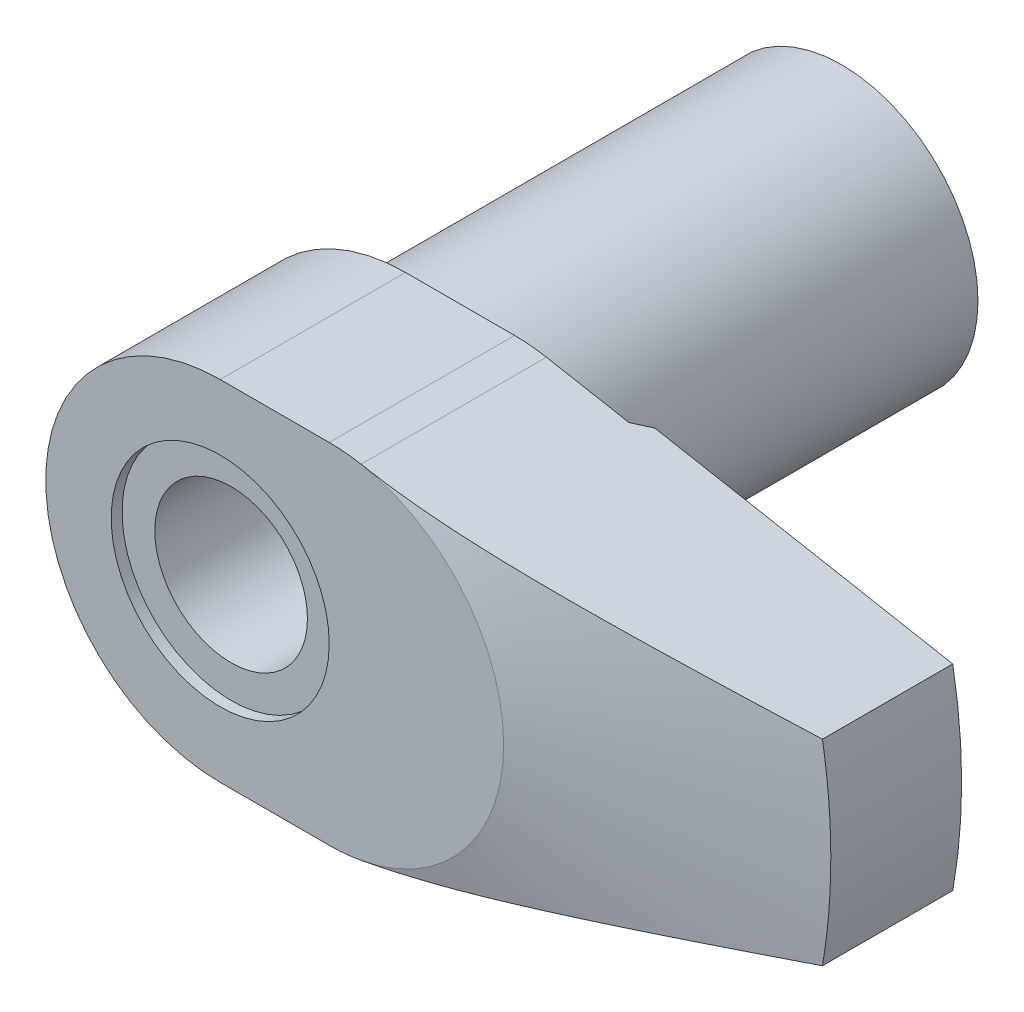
ISO-10303-21;
HEADER;
FILE_DESCRIPTION(('STEP AP214'),'2;1');
FILE_NAME('part.step','',(''),(''),'','','');
FILE_SCHEMA(('AUTOMOTIVE_DESIGN { 1 0 10303 214 1 1 1 1 }'));
ENDSEC;
DATA;
#1=APPLICATION_CONTEXT('core data for automotive mechanical design processes');
#2=APPLICATION_PROTOCOL_DEFINITION('international standard','automotive_design',2000,#1);
#3=PRODUCT_CONTEXT('',#1,'mechanical');
#4=PRODUCT('Part','Part','',(#3));
#5=PRODUCT_RELATED_PRODUCT_CATEGORY('part','',(#4));
#6=PRODUCT_DEFINITION_FORMATION('','',#4);
#7=PRODUCT_DEFINITION_CONTEXT('part definition',#1,'design');
#8=PRODUCT_DEFINITION('design','',#6,#7);
#9=PRODUCT_DEFINITION_SHAPE('','',#8);
#10=(LENGTH_UNIT() NAMED_UNIT(*) SI_UNIT(.MILLI.,.METRE.));
#11=(NAMED_UNIT(*) PLANE_ANGLE_UNIT() SI_UNIT($,.RADIAN.));
#12=(NAMED_UNIT(*) SI_UNIT($,.STERADIAN.) SOLID_ANGLE_UNIT());
#13=UNCERTAINTY_MEASURE_WITH_UNIT(LENGTH_MEASURE(1.E-05),#10,'distance_accuracy_value','');
#14=(GEOMETRIC_REPRESENTATION_CONTEXT(3) GLOBAL_UNCERTAINTY_ASSIGNED_CONTEXT((#13)) GLOBAL_UNIT_ASSIGNED_CONTEXT((#10,
#11,#12)) REPRESENTATION_CONTEXT('',''));
#15=CARTESIAN_POINT('',(0.,0.,0.));
#16=DIRECTION('',(0.,0.,1.));
#17=DIRECTION('',(1.,0.,0.));
#18=AXIS2_PLACEMENT_3D('',#15,#16,#17);
#19=CARTESIAN_POINT('',(10.,0.,39.));
#20=DIRECTION('',(0.,0.,1.));
#21=DIRECTION('',(1.,0.,0.));
#22=AXIS2_PLACEMENT_3D('',#19,#20,#21);
#23=CYLINDRICAL_SURFACE('',#22,16.);
#24=DIRECTION('',(0.,0.,1.));
#25=VECTOR('',#24,1.);
#26=CARTESIAN_POINT('',(12.9200808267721,15.7312786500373,39.));
#27=LINE('',#26,#25);
#28=CARTESIAN_POINT('',(12.9200808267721,15.7312786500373,40.));
#29=VERTEX_POINT('',#28);
#30=CARTESIAN_POINT('',(12.9200808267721,15.7312786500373,57.));
#31=VERTEX_POINT('',#30);
#32=EDGE_CURVE('E137',#29,#31,#27,.T.);
#33=ORIENTED_EDGE('',*,*,#32,.F.);
#34=CARTESIAN_POINT('',(10.,0.,40.));
#35=DIRECTION('',(0.,0.,-1.));
#36=DIRECTION('',(-1.,0.,0.));
#37=AXIS2_PLACEMENT_3D('',#34,#35,#36);
#38=CIRCLE('',#37,16.);
#39=CARTESIAN_POINT('',(10.,16.,40.));
#40=VERTEX_POINT('',#39);
#41=EDGE_CURVE('E214',#40,#29,#38,.T.);
#42=ORIENTED_EDGE('',*,*,#41,.F.);
#43=DIRECTION('',(0.,0.,1.));
#44=VECTOR('',#43,1.);
#45=CARTESIAN_POINT('',(10.,16.,39.));
#46=LINE('',#45,#44);
#47=CARTESIAN_POINT('',(10.,16.,57.));
#48=VERTEX_POINT('',#47);
#49=EDGE_CURVE('E149',#40,#48,#46,.T.);
#50=ORIENTED_EDGE('',*,*,#49,.T.);
#51=CARTESIAN_POINT('',(10.,0.,57.));
#52=DIRECTION('',(0.,0.,1.));
#53=DIRECTION('',(1.,0.,0.));
#54=AXIS2_PLACEMENT_3D('',#51,#52,#53);
#55=CIRCLE('',#54,16.);
#56=EDGE_CURVE('E242',#31,#48,#55,.T.);
#57=ORIENTED_EDGE('',*,*,#56,.F.);
#58=EDGE_LOOP('',(#33,#42,#50,#57));
#59=FACE_BOUND('',#58,.T.);
#60=ADVANCED_FACE('F14',(#59),#23,.T.);
#61=CARTESIAN_POINT('',(49.1833305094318,9.,39.));
#62=DIRECTION('',(0.182505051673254,0.983204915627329,0.));
#63=DIRECTION('',(-0.983204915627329,0.182505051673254,0.));
#64=AXIS2_PLACEMENT_3D('',#61,#62,#63);
#65=PLANE('',#64);
#66=CARTESIAN_POINT('',(49.1835305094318,8.99996287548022,50.9490411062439));
#67=CARTESIAN_POINT('',(48.4363157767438,9.13866281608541,51.1233294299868));
#68=CARTESIAN_POINT('',(47.6889224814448,9.27739590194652,51.2968298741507));
#69=CARTESIAN_POINT('',(46.1937064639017,9.5549417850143,51.6419204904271));
#70=CARTESIAN_POINT('',(45.4458837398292,9.69375458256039,51.8135106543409));
#71=CARTESIAN_POINT('',(43.9498561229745,9.97145111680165,52.1544189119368));
#72=CARTESIAN_POINT('',(43.2016513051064,10.1103348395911,52.3237373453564));
#73=CARTESIAN_POINT('',(41.7046595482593,10.3882103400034,52.6596906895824));
#74=CARTESIAN_POINT('',(40.9558726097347,10.527202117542,52.8263256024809));
#75=CARTESIAN_POINT('',(39.4594248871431,10.8049766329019,53.1559693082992));
#76=CARTESIAN_POINT('',(38.7117657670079,10.94375906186,53.3189859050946));
#77=CARTESIAN_POINT('',(37.2156374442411,11.2214742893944,53.641125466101));
#78=CARTESIAN_POINT('',(36.4671682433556,11.3604070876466,53.8002484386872));
#79=CARTESIAN_POINT('',(34.9690951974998,11.6384832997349,54.1137697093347));
#80=CARTESIAN_POINT('',(34.2194911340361,11.7776267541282,54.2681669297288));
#81=CARTESIAN_POINT('',(32.7191323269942,12.0561272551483,54.571090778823));
#82=CARTESIAN_POINT('',(31.9683775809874,12.1954843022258,54.7196173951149));
#83=CARTESIAN_POINT('',(30.4629252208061,12.4749302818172,55.0098772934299));
#84=CARTESIAN_POINT('',(29.7082229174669,12.6150200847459,55.1515855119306));
#85=CARTESIAN_POINT('',(28.1972026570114,12.8954995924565,55.4258274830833));
#86=CARTESIAN_POINT('',(27.4408847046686,13.0358892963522,55.558361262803));
#87=CARTESIAN_POINT('',(25.9267833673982,13.3169407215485,55.8118665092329));
#88=CARTESIAN_POINT('',(25.1690009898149,13.4576022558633,55.9328441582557));
#89=CARTESIAN_POINT('',(23.6513180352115,13.7393185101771,56.1604558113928));
#90=CARTESIAN_POINT('',(22.8914174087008,13.8803732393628,56.267089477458));
#91=CARTESIAN_POINT('',(21.3673908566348,14.163267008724,56.4628797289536));
#92=CARTESIAN_POINT('',(20.6032590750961,14.3051071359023,56.5519896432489));
#93=CARTESIAN_POINT('',(19.0728856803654,14.5891790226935,56.7086223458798));
#94=CARTESIAN_POINT('',(18.3066442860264,14.7314107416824,56.7761472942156));
#95=CARTESIAN_POINT('',(17.1552699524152,14.9451318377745,56.8586386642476));
#96=CARTESIAN_POINT('',(16.7707772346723,15.0165023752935,56.8830172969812));
#97=CARTESIAN_POINT('',(16.0014376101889,15.1593091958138,56.92510762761));
#98=CARTESIAN_POINT('',(15.6165907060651,15.2307454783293,56.9428193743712));
#99=CARTESIAN_POINT('',(14.8465043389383,15.3736909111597,56.9712828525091));
#100=CARTESIAN_POINT('',(14.461264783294,15.4452000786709,56.9820320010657));
#101=CARTESIAN_POINT('',(13.690644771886,15.5882445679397,56.996402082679));
#102=CARTESIAN_POINT('',(13.3052643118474,15.6597798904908,57.0000227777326));
#103=CARTESIAN_POINT('',(12.919880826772,15.731315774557,56.9999999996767));
#104=B_SPLINE_CURVE_WITH_KNOTS('',3,(#66,#67,#68,#69,#70,#71,#72,#73,#74,#75,#76,#77,#78,#79,
#80,#81,#82,#83,#84,#85,#86,#87,#88,#89,#90,#91,#92,#93,#94,#95,#96,#97,#98,#99,#100,#101,#102,
#103),.UNSPECIFIED.,.F.,.F.,(4,2,2,2,2,2,2,2,2,2,2,2,2,2,2,2,2,2,4),(0.,2.33912374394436,
4.67825752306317,7.01703749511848,9.35581564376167,11.6889301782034,14.0220396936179,
16.3556773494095,18.689319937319,21.0309713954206,23.372615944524,25.7130006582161,
28.0534405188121,30.4000316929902,32.7463879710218,33.9217995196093,35.0972024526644,
36.2730411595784,37.4489191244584),.UNSPECIFIED.);
#105=CARTESIAN_POINT('',(49.1833305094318,9.,50.9490877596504));
#106=VERTEX_POINT('',#105);
#107=EDGE_CURVE('E98',#106,#31,#104,.T.);
#108=ORIENTED_EDGE('',*,*,#107,.F.);
#109=DIRECTION('',(0.,0.,1.));
#110=VECTOR('',#109,1.);
#111=CARTESIAN_POINT('',(49.1833305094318,9.,39.));
#112=LINE('',#111,#110);
#113=CARTESIAN_POINT('',(49.1833305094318,9.,39.));
#114=VERTEX_POINT('',#113);
#115=EDGE_CURVE('E140',#114,#106,#112,.T.);
#116=ORIENTED_EDGE('',*,*,#115,.F.);
#117=DIRECTION('',(-0.983204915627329,0.182505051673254,0.));
#118=VECTOR('',#117,1.);
#119=CARTESIAN_POINT('',(49.1833305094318,9.,39.));
#120=LINE('',#119,#118);
#121=CARTESIAN_POINT('',(21.8632225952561,14.0712294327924,39.));
#122=VERTEX_POINT('',#121);
#123=EDGE_CURVE('E151',#114,#122,#120,.T.);
#124=ORIENTED_EDGE('',*,*,#123,.T.);
#125=CARTESIAN_POINT('',(20.4875288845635,14.3265892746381,40.0002));
#126=CARTESIAN_POINT('',(20.60293771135,14.305166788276,39.917897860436));
#127=CARTESIAN_POINT('',(20.7181524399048,14.2837803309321,39.8353143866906));
#128=CARTESIAN_POINT('',(20.948203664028,14.2410776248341,39.6696090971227));
#129=CARTESIAN_POINT('',(21.0630401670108,14.2197613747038,39.586487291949));
#130=CARTESIAN_POINT('',(21.2923493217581,14.177196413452,39.4197265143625));
#131=CARTESIAN_POINT('',(21.4068219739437,14.1559477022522,39.3360875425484));
#132=CARTESIAN_POINT('',(21.6354174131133,14.1135152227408,39.1683116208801));
#133=CARTESIAN_POINT('',(21.7495401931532,14.092331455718,39.0841746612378));
#134=CARTESIAN_POINT('',(21.8634927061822,14.0711792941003,38.9998));
#135=B_SPLINE_CURVE_WITH_KNOTS('',3,(#125,#126,#127,#128,#129,#130,#131,#132,#133,#134),
.UNSPECIFIED.,.F.,.F.,(4,2,2,2,4),(0.,0.430075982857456,0.860143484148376,1.29021048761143,
1.72028597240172),.UNSPECIFIED.);
#136=CARTESIAN_POINT('',(20.4878093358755,14.3265372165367,40.));
#137=VERTEX_POINT('',#136);
#138=EDGE_CURVE('E190',#137,#122,#135,.T.);
#139=ORIENTED_EDGE('',*,*,#138,.F.);
#140=DIRECTION('',(0.983204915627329,-0.182505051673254,0.));
#141=VECTOR('',#140,1.);
#142=CARTESIAN_POINT('',(12.9200808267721,15.7312786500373,40.));
#143=LINE('',#142,#141);
#144=EDGE_CURVE('E220',#29,#137,#143,.T.);
#145=ORIENTED_EDGE('',*,*,#144,.F.);
#146=ORIENTED_EDGE('',*,*,#32,.T.);
#147=EDGE_LOOP('',(#108,#116,#124,#139,#145,#146));
#148=FACE_BOUND('',#147,.T.);
#149=ADVANCED_FACE('F201',(#148),#65,.T.);
#150=CARTESIAN_POINT('',(49.1833305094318,-9.,39.));
#151=DIRECTION('',(0.182505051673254,-0.983204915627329,0.));
#152=DIRECTION('',(0.983204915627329,0.182505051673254,0.));
#153=AXIS2_PLACEMENT_3D('',#150,#151,#152);
#154=PLANE('',#153);
#155=CARTESIAN_POINT('',(12.9198808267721,-15.731315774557,56.9999999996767));
#156=CARTESIAN_POINT('',(13.2556839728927,-15.6689831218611,57.000013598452));
#157=CARTESIAN_POINT('',(13.5914855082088,-15.6066507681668,56.9972685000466));
#158=CARTESIAN_POINT('',(14.2629969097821,-15.4820030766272,56.9863525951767));
#159=CARTESIAN_POINT('',(14.598706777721,-15.4196877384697,56.9781818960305));
#160=CARTESIAN_POINT('',(15.2698792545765,-15.2951029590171,56.9565090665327));
#161=CARTESIAN_POINT('',(15.6053419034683,-15.2328335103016,56.9430082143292));
#162=CARTESIAN_POINT('',(16.2760267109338,-15.1083392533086,56.9108512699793));
#163=CARTESIAN_POINT('',(16.6112488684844,-15.0461144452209,56.8921951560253));
#164=CARTESIAN_POINT('',(17.6154285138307,-14.8597160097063,56.8288816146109));
#165=CARTESIAN_POINT('',(18.2839458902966,-14.7356240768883,56.7768438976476));
#166=CARTESIAN_POINT('',(19.6194519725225,-14.4877239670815,56.6552810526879));
#167=CARTESIAN_POINT('',(20.2864405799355,-14.3639158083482,56.5857548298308));
#168=CARTESIAN_POINT('',(21.6170626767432,-14.1169222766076,56.4318958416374));
#169=CARTESIAN_POINT('',(22.2807003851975,-13.9937361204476,56.347600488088));
#170=CARTESIAN_POINT('',(23.6062973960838,-13.7476753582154,56.1664804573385));
#171=CARTESIAN_POINT('',(24.268256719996,-13.624800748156,56.0696559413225));
#172=CARTESIAN_POINT('',(25.5909090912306,-13.3792865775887,55.8655833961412));
#173=CARTESIAN_POINT('',(26.2516014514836,-13.2566471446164,55.7583307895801));
#174=CARTESIAN_POINT('',(27.5715919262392,-13.0116270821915,55.5352732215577));
#175=CARTESIAN_POINT('',(28.2308900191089,-12.8892464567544,55.419468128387));
#176=CARTESIAN_POINT('',(29.7391756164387,-12.6092745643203,55.1462586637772));
#177=CARTESIAN_POINT('',(30.5877543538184,-12.4517591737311,54.9865259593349));
#178=CARTESIAN_POINT('',(32.2832079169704,-12.1370446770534,54.657987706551));
#179=CARTESIAN_POINT('',(33.1300827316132,-11.9798455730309,54.4891820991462));
#180=CARTESIAN_POINT('',(34.8223003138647,-11.6657317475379,54.1444787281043));
#181=CARTESIAN_POINT('',(35.6676432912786,-11.5088169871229,53.9685820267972));
#182=CARTESIAN_POINT('',(37.3571768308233,-11.1952013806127,53.6111544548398));
#183=CARTESIAN_POINT('',(38.2013673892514,-11.0385005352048,53.429623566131));
#184=CARTESIAN_POINT('',(39.8914780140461,-10.7247778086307,53.061469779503));
#185=CARTESIAN_POINT('',(40.7373950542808,-10.5677564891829,52.8748325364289));
#186=CARTESIAN_POINT('',(42.4284393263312,-10.2538604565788,52.4978887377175));
#187=CARTESIAN_POINT('',(43.2735665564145,-10.096985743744,52.3075821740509));
#188=CARTESIAN_POINT('',(44.963151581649,-9.78336058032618,51.9239804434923));
#189=CARTESIAN_POINT('',(45.807609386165,-9.62661012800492,51.7306853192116));
#190=CARTESIAN_POINT('',(47.4959636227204,-9.31321342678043,51.3416056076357));
#191=CARTESIAN_POINT('',(48.3398600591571,-9.15656717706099,51.1458210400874));
#192=CARTESIAN_POINT('',(49.1835305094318,-8.99996287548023,50.9490411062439));
#193=B_SPLINE_CURVE_WITH_KNOTS('',3,(#155,#156,#157,#158,#159,#160,#161,#162,#163,#164,#165,
#166,#167,#168,#169,#170,#171,#172,#173,#174,#175,#176,#177,#178,#179,#180,#181,#182,#183,#184,
#185,#186,#187,#188,#189,#190,#191,#192),.UNSPECIFIED.,.F.,.F.,(4,2,2,2,2,2,2,2,2,2,2,2,2,2,2,2,
2,2,4),(0.,1.02460419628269,2.04918812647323,3.07352651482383,4.09786923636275,6.14336042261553,
8.18897969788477,10.2294902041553,12.2699744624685,14.3113584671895,16.3527739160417,
18.9859001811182,21.6190435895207,24.2517939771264,26.8845528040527,29.5256759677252,
32.1668049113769,34.8078962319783,37.4489666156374),.UNSPECIFIED.);
#194=CARTESIAN_POINT('',(12.9200808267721,-15.7312786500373,57.));
#195=VERTEX_POINT('',#194);
#196=CARTESIAN_POINT('',(49.1833305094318,-9.,50.9490877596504));
#197=VERTEX_POINT('',#196);
#198=EDGE_CURVE('E34',#195,#197,#193,.T.);
#199=ORIENTED_EDGE('',*,*,#198,.F.);
#200=DIRECTION('',(0.,0.,1.));
#201=VECTOR('',#200,1.);
#202=CARTESIAN_POINT('',(12.9200808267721,-15.7312786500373,39.));
#203=LINE('',#202,#201);
#204=CARTESIAN_POINT('',(12.9200808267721,-15.7312786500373,40.));
#205=VERTEX_POINT('',#204);
#206=EDGE_CURVE('E110',#205,#195,#203,.T.);
#207=ORIENTED_EDGE('',*,*,#206,.F.);
#208=DIRECTION('',(-0.983204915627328,-0.182505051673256,0.));
#209=VECTOR('',#208,1.);
#210=CARTESIAN_POINT('',(20.4878093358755,-14.3265372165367,40.));
#211=LINE('',#210,#209);
#212=CARTESIAN_POINT('',(20.4878093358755,-14.3265372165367,40.));
#213=VERTEX_POINT('',#212);
#214=EDGE_CURVE('E222',#213,#205,#211,.T.);
#215=ORIENTED_EDGE('',*,*,#214,.F.);
#216=CARTESIAN_POINT('',(21.8634927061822,-14.0711792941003,38.9998));
#217=CARTESIAN_POINT('',(21.7495401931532,-14.092331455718,39.0841746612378));
#218=CARTESIAN_POINT('',(21.6354174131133,-14.1135152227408,39.1683116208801));
#219=CARTESIAN_POINT('',(21.4068219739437,-14.1559477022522,39.3360875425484));
#220=CARTESIAN_POINT('',(21.2923493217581,-14.177196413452,39.4197265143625));
#221=CARTESIAN_POINT('',(21.0630401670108,-14.2197613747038,39.586487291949));
#222=CARTESIAN_POINT('',(20.948203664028,-14.2410776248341,39.6696090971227));
#223=CARTESIAN_POINT('',(20.7181524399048,-14.2837803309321,39.8353143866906));
#224=CARTESIAN_POINT('',(20.60293771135,-14.305166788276,39.917897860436));
#225=CARTESIAN_POINT('',(20.4875288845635,-14.3265892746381,40.0002));
#226=B_SPLINE_CURVE_WITH_KNOTS('',3,(#216,#217,#218,#219,#220,#221,#222,#223,#224,#225),
.UNSPECIFIED.,.F.,.F.,(4,2,2,2,4),(0.,0.430075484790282,0.860142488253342,1.29020998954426,
1.72028597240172),.UNSPECIFIED.);
#227=CARTESIAN_POINT('',(21.8632225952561,-14.0712294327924,39.));
#228=VERTEX_POINT('',#227);
#229=EDGE_CURVE('E28',#228,#213,#226,.T.);
#230=ORIENTED_EDGE('',*,*,#229,.F.);
#231=DIRECTION('',(0.983204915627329,0.182505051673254,0.));
#232=VECTOR('',#231,1.);
#233=CARTESIAN_POINT('',(49.1833305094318,-9.,39.));
#234=LINE('',#233,#232);
#235=CARTESIAN_POINT('',(49.1833305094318,-9.,39.));
#236=VERTEX_POINT('',#235);
#237=EDGE_CURVE('E129',#228,#236,#234,.T.);
#238=ORIENTED_EDGE('',*,*,#237,.T.);
#239=DIRECTION('',(0.,0.,1.));
#240=VECTOR('',#239,1.);
#241=CARTESIAN_POINT('',(49.1833305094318,-9.,39.));
#242=LINE('',#241,#240);
#243=EDGE_CURVE('E112',#236,#197,#242,.T.);
#244=ORIENTED_EDGE('',*,*,#243,.T.);
#245=EDGE_LOOP('',(#199,#207,#215,#230,#238,#244));
#246=FACE_BOUND('',#245,.T.);
#247=ADVANCED_FACE('F108',(#246),#154,.T.);
#248=CARTESIAN_POINT('',(10.,0.,39.));
#249=DIRECTION('',(0.,0.,1.));
#250=DIRECTION('',(1.,0.,0.));
#251=AXIS2_PLACEMENT_3D('',#248,#249,#250);
#252=CYLINDRICAL_SURFACE('',#251,16.);
#253=DIRECTION('',(0.,0.,1.));
#254=VECTOR('',#253,1.);
#255=CARTESIAN_POINT('',(10.,-16.,39.));
#256=LINE('',#255,#254);
#257=CARTESIAN_POINT('',(10.,-16.,40.));
#258=VERTEX_POINT('',#257);
#259=CARTESIAN_POINT('',(10.,-16.,57.));
#260=VERTEX_POINT('',#259);
#261=EDGE_CURVE('E122',#258,#260,#256,.T.);
#262=ORIENTED_EDGE('',*,*,#261,.F.);
#263=CARTESIAN_POINT('',(10.,0.,40.));
#264=DIRECTION('',(0.,0.,-1.));
#265=DIRECTION('',(-1.,0.,0.));
#266=AXIS2_PLACEMENT_3D('',#263,#264,#265);
#267=CIRCLE('',#266,16.);
#268=EDGE_CURVE('E121',#205,#258,#267,.T.);
#269=ORIENTED_EDGE('',*,*,#268,.F.);
#270=ORIENTED_EDGE('',*,*,#206,.T.);
#271=CARTESIAN_POINT('',(10.,0.,57.));
#272=DIRECTION('',(0.,0.,1.));
#273=DIRECTION('',(1.,0.,0.));
#274=AXIS2_PLACEMENT_3D('',#271,#272,#273);
#275=CIRCLE('',#274,16.);
#276=EDGE_CURVE('E119',#260,#195,#275,.T.);
#277=ORIENTED_EDGE('',*,*,#276,.F.);
#278=EDGE_LOOP('',(#262,#269,#270,#277));
#279=FACE_BOUND('',#278,.T.);
#280=ADVANCED_FACE('F118',(#279),#252,.T.);
#281=CARTESIAN_POINT('',(10.,-16.,39.));
#282=DIRECTION('',(0.,-1.,0.));
#283=DIRECTION('',(1.,0.,0.));
#284=AXIS2_PLACEMENT_3D('',#281,#282,#283);
#285=PLANE('',#284);
#286=DIRECTION('',(0.,0.,1.));
#287=VECTOR('',#286,1.);
#288=CARTESIAN_POINT('',(1.6759120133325E-13,-16.,39.));
#289=LINE('',#288,#287);
#290=CARTESIAN_POINT('',(0.,-16.,40.));
#291=VERTEX_POINT('',#290);
#292=CARTESIAN_POINT('',(1.6759120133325E-13,-16.,57.));
#293=VERTEX_POINT('',#292);
#294=EDGE_CURVE('E145',#291,#293,#289,.T.);
#295=ORIENTED_EDGE('',*,*,#294,.F.);
#296=DIRECTION('',(-1.,0.,0.));
#297=VECTOR('',#296,1.);
#298=CARTESIAN_POINT('',(10.,-16.,40.));
#299=LINE('',#298,#297);
#300=EDGE_CURVE('E225',#258,#291,#299,.T.);
#301=ORIENTED_EDGE('',*,*,#300,.F.);
#302=ORIENTED_EDGE('',*,*,#261,.T.);
#303=DIRECTION('',(1.,0.,0.));
#304=VECTOR('',#303,1.);
#305=CARTESIAN_POINT('',(10.,-16.,57.));
#306=LINE('',#305,#304);
#307=EDGE_CURVE('E128',#293,#260,#306,.T.);
#308=ORIENTED_EDGE('',*,*,#307,.F.);
#309=EDGE_LOOP('',(#295,#301,#302,#308));
#310=FACE_BOUND('',#309,.T.);
#311=ADVANCED_FACE('F257',(#310),#285,.T.);
#312=CARTESIAN_POINT('',(10.,16.,39.));
#313=DIRECTION('',(0.,1.,0.));
#314=DIRECTION('',(-1.,0.,0.));
#315=AXIS2_PLACEMENT_3D('',#312,#313,#314);
#316=PLANE('',#315);
#317=ORIENTED_EDGE('',*,*,#49,.F.);
#318=DIRECTION('',(1.,0.,0.));
#319=VECTOR('',#318,1.);
#320=CARTESIAN_POINT('',(0.,16.,40.));
#321=LINE('',#320,#319);
#322=CARTESIAN_POINT('',(0.,16.,40.));
#323=VERTEX_POINT('',#322);
#324=EDGE_CURVE('E227',#323,#40,#321,.T.);
#325=ORIENTED_EDGE('',*,*,#324,.F.);
#326=DIRECTION('',(0.,0.,1.));
#327=VECTOR('',#326,1.);
#328=CARTESIAN_POINT('',(0.,16.,39.));
#329=LINE('',#328,#327);
#330=CARTESIAN_POINT('',(0.,16.,57.));
#331=VERTEX_POINT('',#330);
#332=EDGE_CURVE('E147',#323,#331,#329,.T.);
#333=ORIENTED_EDGE('',*,*,#332,.T.);
#334=DIRECTION('',(-1.,0.,0.));
#335=VECTOR('',#334,1.);
#336=CARTESIAN_POINT('',(10.,16.,57.));
#337=LINE('',#336,#335);
#338=EDGE_CURVE('E133',#48,#331,#337,.T.);
#339=ORIENTED_EDGE('',*,*,#338,.F.);
#340=EDGE_LOOP('',(#317,#325,#333,#339));
#341=FACE_BOUND('',#340,.T.);
#342=ADVANCED_FACE('F262',(#341),#316,.T.);
#343=CARTESIAN_POINT('',(0.,0.,57.));
#344=DIRECTION('',(0.,0.,-1.));
#345=DIRECTION('',(-1.,0.,0.));
#346=AXIS2_PLACEMENT_3D('',#343,#344,#345);
#347=CYLINDRICAL_SURFACE('',#346,16.);
#348=CARTESIAN_POINT('',(0.,0.,40.));
#349=DIRECTION('',(0.,0.,1.));
#350=DIRECTION('',(1.,0.,0.));
#351=AXIS2_PLACEMENT_3D('',#348,#349,#350);
#352=CIRCLE('',#351,16.);
#353=EDGE_CURVE('E197',#323,#291,#352,.T.);
#354=ORIENTED_EDGE('',*,*,#353,.T.);
#355=ORIENTED_EDGE('',*,*,#294,.T.);
#356=CARTESIAN_POINT('',(0.,0.,57.));
#357=DIRECTION('',(0.,0.,1.));
#358=DIRECTION('',(1.,0.,0.));
#359=AXIS2_PLACEMENT_3D('',#356,#357,#358);
#360=CIRCLE('',#359,16.);
#361=EDGE_CURVE('E170',#331,#293,#360,.T.);
#362=ORIENTED_EDGE('',*,*,#361,.F.);
#363=ORIENTED_EDGE('',*,*,#332,.F.);
#364=EDGE_LOOP('',(#354,#355,#362,#363));
#365=FACE_BOUND('',#364,.T.);
#366=ADVANCED_FACE('F16',(#365),#347,.T.);
#367=CARTESIAN_POINT('',(60.,20.,39.));
#368=DIRECTION('',(0.,0.,1.));
#369=DIRECTION('',(1.,0.,0.));
#370=AXIS2_PLACEMENT_3D('',#367,#368,#369);
#371=PLANE('',#370);
#372=ORIENTED_EDGE('',*,*,#237,.F.);
#373=CARTESIAN_POINT('',(0.,0.,39.));
#374=DIRECTION('',(0.,0.,1.));
#375=DIRECTION('',(1.,0.,0.));
#376=AXIS2_PLACEMENT_3D('',#373,#374,#375);
#377=CIRCLE('',#376,26.);
#378=EDGE_CURVE('E42',#228,#122,#377,.T.);
#379=ORIENTED_EDGE('',*,*,#378,.T.);
#380=ORIENTED_EDGE('',*,*,#123,.F.);
#381=CARTESIAN_POINT('',(0.,0.,39.));
#382=DIRECTION('',(0.,0.,1.));
#383=DIRECTION('',(1.,0.,0.));
#384=AXIS2_PLACEMENT_3D('',#381,#382,#383);
#385=CIRCLE('',#384,50.);
#386=EDGE_CURVE('E131',#236,#114,#385,.T.);
#387=ORIENTED_EDGE('',*,*,#386,.F.);
#388=EDGE_LOOP('',(#372,#379,#380,#387));
#389=FACE_BOUND('',#388,.T.);
#390=ADVANCED_FACE('F258',(#389),#371,.F.);
#391=CARTESIAN_POINT('',(0.,0.,0.));
#392=DIRECTION('',(0.,0.,-1.));
#393=DIRECTION('',(-1.,0.,0.));
#394=AXIS2_PLACEMENT_3D('',#391,#392,#393);
#395=CYLINDRICAL_SURFACE('',#394,7.);
#396=CARTESIAN_POINT('',(0.,0.,34.));
#397=DIRECTION('',(0.,0.,-1.));
#398=DIRECTION('',(-1.,0.,0.));
#399=AXIS2_PLACEMENT_3D('',#396,#397,#398);
#400=CIRCLE('',#399,7.);
#401=CARTESIAN_POINT('',(-7.,0.,34.));
#402=VERTEX_POINT('',#401);
#403=EDGE_CURVE('E158',#402,#402,#400,.T.);
#404=ORIENTED_EDGE('',*,*,#403,.T.);
#405=EDGE_LOOP('',(#404));
#406=FACE_BOUND('',#405,.T.);
#407=CARTESIAN_POINT('',(0.,0.,56.));
#408=DIRECTION('',(0.,0.,1.));
#409=DIRECTION('',(1.,0.,0.));
#410=AXIS2_PLACEMENT_3D('',#407,#408,#409);
#411=CIRCLE('',#410,7.);
#412=CARTESIAN_POINT('',(7.,0.,56.));
#413=VERTEX_POINT('',#412);
#414=EDGE_CURVE('E155',#413,#413,#411,.T.);
#415=ORIENTED_EDGE('',*,*,#414,.T.);
#416=EDGE_LOOP('',(#415));
#417=FACE_BOUND('',#416,.T.);
#418=ADVANCED_FACE('F287',(#406,#417),#395,.F.);
#419=CARTESIAN_POINT('',(0.,0.,0.));
#420=DIRECTION('',(0.,0.,1.));
#421=DIRECTION('',(1.,0.,0.));
#422=AXIS2_PLACEMENT_3D('',#419,#420,#421);
#423=PLANE('',#422);
#424=CARTESIAN_POINT('',(0.,0.,0.));
#425=DIRECTION('',(0.,0.,-1.));
#426=DIRECTION('',(-1.,0.,0.));
#427=AXIS2_PLACEMENT_3D('',#424,#425,#426);
#428=CIRCLE('',#427,12.5);
#429=CARTESIAN_POINT('',(-12.5,0.,0.));
#430=VERTEX_POINT('',#429);
#431=EDGE_CURVE('E167',#430,#430,#428,.T.);
#432=ORIENTED_EDGE('',*,*,#431,.T.);
#433=EDGE_LOOP('',(#432));
#434=FACE_BOUND('',#433,.T.);
#435=CARTESIAN_POINT('',(0.,0.,0.));
#436=DIRECTION('',(0.,0.,-1.));
#437=DIRECTION('',(-1.,0.,0.));
#438=AXIS2_PLACEMENT_3D('',#435,#436,#437);
#439=CIRCLE('',#438,9.5);
#440=CARTESIAN_POINT('',(-9.5,0.,0.));
#441=VERTEX_POINT('',#440);
#442=EDGE_CURVE('E164',#441,#441,#439,.T.);
#443=ORIENTED_EDGE('',*,*,#442,.F.);
#444=EDGE_LOOP('',(#443));
#445=FACE_BOUND('',#444,.T.);
#446=ADVANCED_FACE('F290',(#434,#445),#423,.F.);
#447=CARTESIAN_POINT('',(0.,0.,57.));
#448=DIRECTION('',(0.,0.,1.));
#449=DIRECTION('',(1.,0.,0.));
#450=AXIS2_PLACEMENT_3D('',#447,#448,#449);
#451=PLANE('',#450);
#452=CARTESIAN_POINT('',(10.,0.,57.));
#453=DIRECTION('',(0.,0.,1.));
#454=DIRECTION('',(1.,0.,0.));
#455=AXIS2_PLACEMENT_3D('',#452,#453,#454);
#456=CIRCLE('',#455,16.);
#457=EDGE_CURVE('E95',#195,#31,#456,.T.);
#458=ORIENTED_EDGE('',*,*,#457,.T.);
#459=ORIENTED_EDGE('',*,*,#56,.T.);
#460=ORIENTED_EDGE('',*,*,#338,.T.);
#461=ORIENTED_EDGE('',*,*,#361,.T.);
#462=ORIENTED_EDGE('',*,*,#307,.T.);
#463=ORIENTED_EDGE('',*,*,#276,.T.);
#464=EDGE_LOOP('',(#458,#459,#460,#461,#462,#463));
#465=FACE_BOUND('',#464,.T.);
#466=CARTESIAN_POINT('',(0.,0.,57.));
#467=DIRECTION('',(0.,0.,1.));
#468=DIRECTION('',(1.,0.,0.));
#469=AXIS2_PLACEMENT_3D('',#466,#467,#468);
#470=CIRCLE('',#469,10.);
#471=CARTESIAN_POINT('',(10.,0.,57.));
#472=VERTEX_POINT('',#471);
#473=EDGE_CURVE('E139',#472,#472,#470,.T.);
#474=ORIENTED_EDGE('',*,*,#473,.F.);
#475=EDGE_LOOP('',(#474));
#476=FACE_BOUND('',#475,.T.);
#477=ADVANCED_FACE('F124',(#465,#476),#451,.T.);
#478=CARTESIAN_POINT('',(0.,0.,39.));
#479=DIRECTION('',(0.,0.,-1.));
#480=DIRECTION('',(-1.,0.,0.));
#481=AXIS2_PLACEMENT_3D('',#478,#479,#480);
#482=CYLINDRICAL_SURFACE('',#481,12.5);
#483=ORIENTED_EDGE('',*,*,#431,.F.);
#484=EDGE_LOOP('',(#483));
#485=FACE_BOUND('',#484,.T.);
#486=CARTESIAN_POINT('',(0.,0.,40.));
#487=DIRECTION('',(0.,0.,1.));
#488=DIRECTION('',(1.,0.,0.));
#489=AXIS2_PLACEMENT_3D('',#486,#487,#488);
#490=CIRCLE('',#489,12.5);
#491=CARTESIAN_POINT('',(12.5,0.,40.));
#492=VERTEX_POINT('',#491);
#493=EDGE_CURVE('E243',#492,#492,#490,.T.);
#494=ORIENTED_EDGE('',*,*,#493,.F.);
#495=EDGE_LOOP('',(#494));
#496=FACE_BOUND('',#495,.T.);
#497=ADVANCED_FACE('F298',(#485,#496),#482,.T.);
#498=CARTESIAN_POINT('',(0.,0.,0.));
#499=DIRECTION('',(0.,0.,-1.));
#500=DIRECTION('',(-1.,0.,0.));
#501=AXIS2_PLACEMENT_3D('',#498,#499,#500);
#502=CYLINDRICAL_SURFACE('',#501,9.5);
#503=ORIENTED_EDGE('',*,*,#442,.T.);
#504=EDGE_LOOP('',(#503));
#505=FACE_BOUND('',#504,.T.);
#506=CARTESIAN_POINT('',(0.,0.,34.));
#507=DIRECTION('',(0.,0.,-1.));
#508=DIRECTION('',(-1.,0.,0.));
#509=AXIS2_PLACEMENT_3D('',#506,#507,#508);
#510=CIRCLE('',#509,9.5);
#511=CARTESIAN_POINT('',(-9.5,0.,34.));
#512=VERTEX_POINT('',#511);
#513=EDGE_CURVE('E161',#512,#512,#510,.T.);
#514=ORIENTED_EDGE('',*,*,#513,.F.);
#515=EDGE_LOOP('',(#514));
#516=FACE_BOUND('',#515,.T.);
#517=ADVANCED_FACE('F294',(#505,#516),#502,.F.);
#518=CARTESIAN_POINT('',(7.,0.,34.));
#519=DIRECTION('',(0.,0.,-1.));
#520=DIRECTION('',(-1.,0.,0.));
#521=AXIS2_PLACEMENT_3D('',#518,#519,#520);
#522=PLANE('',#521);
#523=ORIENTED_EDGE('',*,*,#513,.T.);
#524=EDGE_LOOP('',(#523));
#525=FACE_BOUND('',#524,.T.);
#526=ORIENTED_EDGE('',*,*,#403,.F.);
#527=EDGE_LOOP('',(#526));
#528=FACE_BOUND('',#527,.T.);
#529=ADVANCED_FACE('F285',(#525,#528),#522,.T.);
#530=CARTESIAN_POINT('',(0.,0.,56.));
#531=DIRECTION('',(0.,0.,1.));
#532=DIRECTION('',(1.,0.,0.));
#533=AXIS2_PLACEMENT_3D('',#530,#531,#532);
#534=CYLINDRICAL_SURFACE('',#533,10.);
#535=CARTESIAN_POINT('',(0.,0.,56.));
#536=DIRECTION('',(0.,0.,1.));
#537=DIRECTION('',(1.,0.,0.));
#538=AXIS2_PLACEMENT_3D('',#535,#536,#537);
#539=CIRCLE('',#538,10.);
#540=CARTESIAN_POINT('',(10.,0.,56.));
#541=VERTEX_POINT('',#540);
#542=EDGE_CURVE('E152',#541,#541,#539,.T.);
#543=ORIENTED_EDGE('',*,*,#542,.F.);
#544=EDGE_LOOP('',(#543));
#545=FACE_BOUND('',#544,.T.);
#546=ORIENTED_EDGE('',*,*,#473,.T.);
#547=EDGE_LOOP('',(#546));
#548=FACE_BOUND('',#547,.T.);
#549=ADVANCED_FACE('F281',(#545,#548),#534,.F.);
#550=CARTESIAN_POINT('',(0.,0.,56.));
#551=DIRECTION('',(0.,0.,1.));
#552=DIRECTION('',(1.,0.,0.));
#553=AXIS2_PLACEMENT_3D('',#550,#551,#552);
#554=PLANE('',#553);
#555=ORIENTED_EDGE('',*,*,#414,.F.);
#556=EDGE_LOOP('',(#555));
#557=FACE_BOUND('',#556,.T.);
#558=ORIENTED_EDGE('',*,*,#542,.T.);
#559=EDGE_LOOP('',(#558));
#560=FACE_BOUND('',#559,.T.);
#561=ADVANCED_FACE('F278',(#557,#560),#554,.T.);
#562=CARTESIAN_POINT('',(0.,0.,39.));
#563=DIRECTION('',(0.,0.,1.));
#564=DIRECTION('',(1.,0.,0.));
#565=AXIS2_PLACEMENT_3D('',#562,#563,#564);
#566=CYLINDRICAL_SURFACE('',#565,50.);
#567=CARTESIAN_POINT('',(49.1832939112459,-9.0002,50.9490854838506));
#568=CARTESIAN_POINT('',(49.3196030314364,-8.25538525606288,50.9575623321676));
#569=CARTESIAN_POINT('',(49.4389702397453,-7.50745839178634,50.9649950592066));
#570=CARTESIAN_POINT('',(49.6436263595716,-6.00694322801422,50.9777491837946));
#571=CARTESIAN_POINT('',(49.7289154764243,-5.25435495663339,50.9830705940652));
#572=CARTESIAN_POINT('',(49.8646672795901,-3.75221544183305,50.9915444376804));
#573=CARTESIAN_POINT('',(49.9154080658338,-3.00268941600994,50.9947141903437));
#574=CARTESIAN_POINT('',(49.9830743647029,-1.50210892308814,50.9989419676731));
#575=CARTESIAN_POINT('',(50.,-0.751054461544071,51.));
#576=CARTESIAN_POINT('',(50.,0.751054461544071,51.));
#577=CARTESIAN_POINT('',(49.9830743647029,1.50210892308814,50.9989419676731));
#578=CARTESIAN_POINT('',(49.9154080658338,3.00268941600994,50.9947141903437));
#579=CARTESIAN_POINT('',(49.8646672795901,3.75221544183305,50.9915444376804));
#580=CARTESIAN_POINT('',(49.7289154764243,5.25435495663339,50.9830705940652));
#581=CARTESIAN_POINT('',(49.6436263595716,6.00694322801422,50.9777491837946));
#582=CARTESIAN_POINT('',(49.4389702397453,7.50745839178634,50.9649950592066));
#583=CARTESIAN_POINT('',(49.3196030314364,8.25538525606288,50.9575623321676));
#584=CARTESIAN_POINT('',(49.1832939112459,9.0002,50.9490854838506));
#585=B_SPLINE_CURVE_WITH_KNOTS('',3,(#567,#568,#569,#570,#571,#572,#573,#574,#575,#576,#577,
#578,#579,#580,#581,#582,#583,#584),.UNSPECIFIED.,.F.,.F.,(4,2,2,2,2,2,2,2,4),(0.,
2.27150161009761,4.54298953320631,6.79596960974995,9.04894151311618,11.3019134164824,
13.5548934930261,15.8263814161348,18.0978830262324),.UNSPECIFIED.);
#586=EDGE_CURVE('E9',#197,#106,#585,.T.);
#587=ORIENTED_EDGE('',*,*,#586,.F.);
#588=ORIENTED_EDGE('',*,*,#243,.F.);
#589=ORIENTED_EDGE('',*,*,#386,.T.);
#590=ORIENTED_EDGE('',*,*,#115,.T.);
#591=EDGE_LOOP('',(#587,#588,#589,#590));
#592=FACE_BOUND('',#591,.T.);
#593=ADVANCED_FACE('F205',(#592),#566,.T.);
#594=CARTESIAN_POINT('',(-12.5,0.,40.));
#595=DIRECTION('',(0.,0.,-1.));
#596=DIRECTION('',(-1.,0.,0.));
#597=AXIS2_PLACEMENT_3D('',#594,#595,#596);
#598=PLANE('',#597);
#599=ORIENTED_EDGE('',*,*,#493,.T.);
#600=EDGE_LOOP('',(#599));
#601=FACE_BOUND('',#600,.T.);
#602=ORIENTED_EDGE('',*,*,#353,.F.);
#603=ORIENTED_EDGE('',*,*,#324,.T.);
#604=ORIENTED_EDGE('',*,*,#41,.T.);
#605=ORIENTED_EDGE('',*,*,#144,.T.);
#606=CARTESIAN_POINT('',(0.,0.,40.));
#607=DIRECTION('',(0.,0.,1.));
#608=DIRECTION('',(1.,0.,0.));
#609=AXIS2_PLACEMENT_3D('',#606,#607,#608);
#610=CIRCLE('',#609,25.);
#611=EDGE_CURVE('E198',#213,#137,#610,.T.);
#612=ORIENTED_EDGE('',*,*,#611,.F.);
#613=ORIENTED_EDGE('',*,*,#214,.T.);
#614=ORIENTED_EDGE('',*,*,#268,.T.);
#615=ORIENTED_EDGE('',*,*,#300,.T.);
#616=EDGE_LOOP('',(#602,#603,#604,#605,#612,#613,#614,#615));
#617=FACE_BOUND('',#616,.T.);
#618=ADVANCED_FACE('F185',(#601,#617),#598,.T.);
#619=CARTESIAN_POINT('',(0.,0.,40.));
#620=DIRECTION('',(0.,0.,-1.));
#621=DIRECTION('',(-1.,0.,0.));
#622=AXIS2_PLACEMENT_3D('',#619,#620,#621);
#623=CONICAL_SURFACE('',#622,25.,0.785398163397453);
#624=ORIENTED_EDGE('',*,*,#138,.T.);
#625=ORIENTED_EDGE('',*,*,#378,.F.);
#626=ORIENTED_EDGE('',*,*,#229,.T.);
#627=ORIENTED_EDGE('',*,*,#611,.T.);
#628=EDGE_LOOP('',(#624,#625,#626,#627));
#629=FACE_BOUND('',#628,.T.);
#630=ADVANCED_FACE('F181',(#629),#623,.F.);
#631=CARTESIAN_POINT('',(10.,0.,49.2735782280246));
#632=DIRECTION('',(0.,0.,-1.));
#633=DIRECTION('',(-1.,0.,0.));
#634=AXIS2_PLACEMENT_3D('',#631,#632,#633);
#635=CONICAL_SURFACE('',#634,46.9056870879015,1.32581766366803);
#636=ORIENTED_EDGE('',*,*,#107,.T.);
#637=ORIENTED_EDGE('',*,*,#457,.F.);
#638=ORIENTED_EDGE('',*,*,#198,.T.);
#639=ORIENTED_EDGE('',*,*,#586,.T.);
#640=EDGE_LOOP('',(#636,#637,#638,#639));
#641=FACE_BOUND('',#640,.T.);
#642=ADVANCED_FACE('F96',(#641),#635,.T.);
#643=CLOSED_SHELL('',(#60,#149,#247,#280,#311,#342,#366,#390,#418,#446,#477,#497,#517,#529,#549,
#561,#593,#618,#630,#642));
#644=MANIFOLD_SOLID_BREP('B1',#643);
#645=ADVANCED_BREP_SHAPE_REPRESENTATION('',(#18,#644),#14);
#646=SHAPE_DEFINITION_REPRESENTATION(#9,#645);
ENDSEC;
END-ISO-10303-21;
